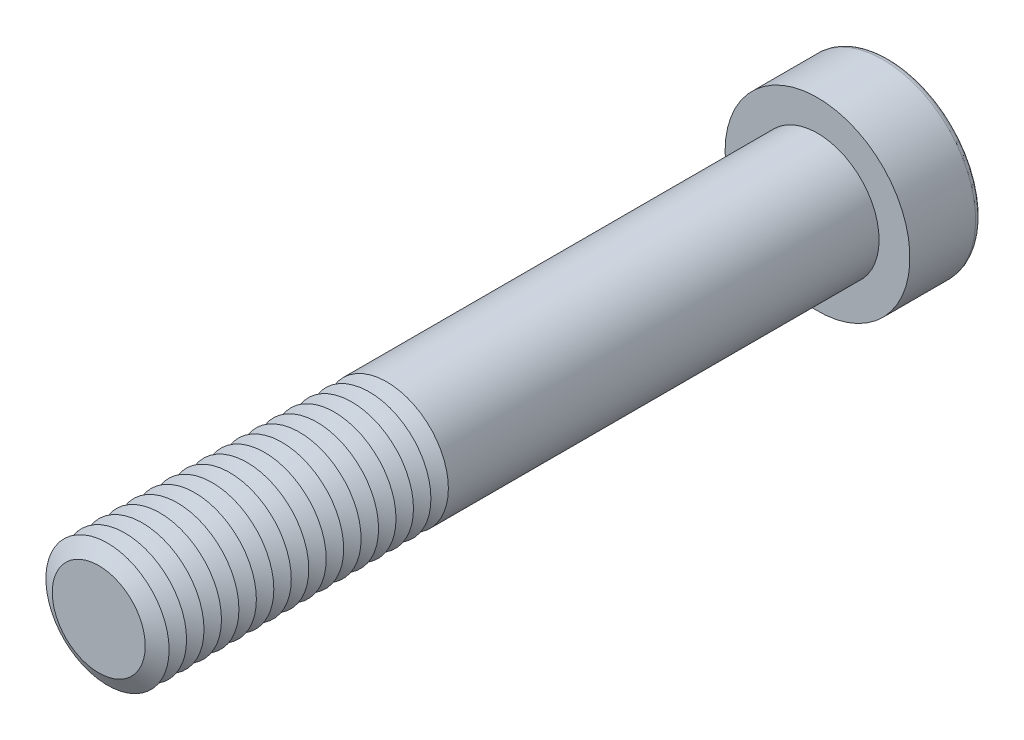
ISO-10303-21;
HEADER;
FILE_DESCRIPTION(('STEP AP214'),'2;1');
FILE_NAME('part.step','',(''),(''),'','','');
FILE_SCHEMA(('AUTOMOTIVE_DESIGN { 1 0 10303 214 1 1 1 1 }'));
ENDSEC;
DATA;
#1=APPLICATION_CONTEXT('core data for automotive mechanical design processes');
#2=APPLICATION_PROTOCOL_DEFINITION('international standard','automotive_design',2000,#1);
#3=PRODUCT_CONTEXT('',#1,'mechanical');
#4=PRODUCT('Part','Part','',(#3));
#5=PRODUCT_RELATED_PRODUCT_CATEGORY('part','',(#4));
#6=PRODUCT_DEFINITION_FORMATION('','',#4);
#7=PRODUCT_DEFINITION_CONTEXT('part definition',#1,'design');
#8=PRODUCT_DEFINITION('design','',#6,#7);
#9=PRODUCT_DEFINITION_SHAPE('','',#8);
#10=(LENGTH_UNIT() NAMED_UNIT(*) SI_UNIT(.MILLI.,.METRE.));
#11=(NAMED_UNIT(*) PLANE_ANGLE_UNIT() SI_UNIT($,.RADIAN.));
#12=(NAMED_UNIT(*) SI_UNIT($,.STERADIAN.) SOLID_ANGLE_UNIT());
#13=UNCERTAINTY_MEASURE_WITH_UNIT(LENGTH_MEASURE(1.E-05),#10,'distance_accuracy_value','');
#14=(GEOMETRIC_REPRESENTATION_CONTEXT(3) GLOBAL_UNCERTAINTY_ASSIGNED_CONTEXT((#13)) GLOBAL_UNIT_ASSIGNED_CONTEXT((#10,
#11,#12)) REPRESENTATION_CONTEXT('',''));
#15=CARTESIAN_POINT('',(0.,0.,0.));
#16=DIRECTION('',(0.,0.,1.));
#17=DIRECTION('',(1.,0.,0.));
#18=AXIS2_PLACEMENT_3D('',#15,#16,#17);
#19=CARTESIAN_POINT('',(0.,0.,64.05));
#20=DIRECTION('',(0.,0.,1.));
#21=DIRECTION('',(1.,0.,0.));
#22=AXIS2_PLACEMENT_3D('',#19,#20,#21);
#23=CONICAL_SURFACE('',#22,6.,1.0471975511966);
#24=CARTESIAN_POINT('',(0.,0.,63.2));
#25=DIRECTION('',(0.,0.,1.));
#26=DIRECTION('',(1.,0.,0.));
#27=AXIS2_PLACEMENT_3D('',#24,#25,#26);
#28=CIRCLE('',#27,4.52775681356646);
#29=CARTESIAN_POINT('',(4.52775681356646,0.,63.2));
#30=VERTEX_POINT('',#29);
#31=EDGE_CURVE('E311',#30,#30,#28,.T.);
#32=ORIENTED_EDGE('',*,*,#31,.T.);
#33=EDGE_LOOP('',(#32));
#34=FACE_BOUND('',#33,.T.);
#35=CARTESIAN_POINT('',(0.,0.,64.05));
#36=DIRECTION('',(0.,0.,1.));
#37=DIRECTION('',(1.,0.,0.));
#38=AXIS2_PLACEMENT_3D('',#35,#36,#37);
#39=CIRCLE('',#38,6.);
#40=CARTESIAN_POINT('',(6.,0.,64.05));
#41=VERTEX_POINT('',#40);
#42=EDGE_CURVE('E314',#41,#41,#39,.T.);
#43=ORIENTED_EDGE('',*,*,#42,.F.);
#44=EDGE_LOOP('',(#43));
#45=FACE_BOUND('',#44,.T.);
#46=ADVANCED_FACE('F39',(#34,#45),#23,.T.);
#47=CARTESIAN_POINT('',(0.,0.,63.2));
#48=DIRECTION('',(0.,0.,-1.));
#49=DIRECTION('',(-1.,0.,0.));
#50=AXIS2_PLACEMENT_3D('',#47,#48,#49);
#51=CONICAL_SURFACE('',#50,4.52775681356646,1.0471975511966);
#52=CARTESIAN_POINT('',(0.,0.,62.35));
#53=DIRECTION('',(0.,0.,1.));
#54=DIRECTION('',(1.,0.,0.));
#55=AXIS2_PLACEMENT_3D('',#52,#53,#54);
#56=CIRCLE('',#55,6.);
#57=CARTESIAN_POINT('',(6.,0.,62.35));
#58=VERTEX_POINT('',#57);
#59=EDGE_CURVE('E322',#58,#58,#56,.T.);
#60=ORIENTED_EDGE('',*,*,#59,.T.);
#61=EDGE_LOOP('',(#60));
#62=FACE_BOUND('',#61,.T.);
#63=ORIENTED_EDGE('',*,*,#31,.F.);
#64=EDGE_LOOP('',(#63));
#65=FACE_BOUND('',#64,.T.);
#66=ADVANCED_FACE('F243',(#62,#65),#51,.T.);
#67=CARTESIAN_POINT('',(0.,0.,70.));
#68=DIRECTION('',(0.,0.,1.));
#69=DIRECTION('',(1.,0.,0.));
#70=AXIS2_PLACEMENT_3D('',#67,#68,#69);
#71=PLANE('',#70);
#72=CARTESIAN_POINT('',(0.,0.,70.));
#73=DIRECTION('',(0.,0.,1.));
#74=DIRECTION('',(1.,0.,0.));
#75=AXIS2_PLACEMENT_3D('',#72,#73,#74);
#76=CIRCLE('',#75,4.52775681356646);
#77=CARTESIAN_POINT('',(4.52775681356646,0.,70.));
#78=VERTEX_POINT('',#77);
#79=EDGE_CURVE('E172',#78,#78,#76,.T.);
#80=ORIENTED_EDGE('',*,*,#79,.T.);
#81=EDGE_LOOP('',(#80));
#82=FACE_BOUND('',#81,.T.);
#83=ADVANCED_FACE('F249',(#82),#71,.T.);
#84=CARTESIAN_POINT('',(0.,0.,70.));
#85=DIRECTION('',(0.,0.,-1.));
#86=DIRECTION('',(-1.,0.,0.));
#87=AXIS2_PLACEMENT_3D('',#84,#85,#86);
#88=CONICAL_SURFACE('',#87,4.52775681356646,1.0471975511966);
#89=CARTESIAN_POINT('',(0.,0.,69.15));
#90=DIRECTION('',(0.,0.,1.));
#91=DIRECTION('',(1.,0.,0.));
#92=AXIS2_PLACEMENT_3D('',#89,#90,#91);
#93=CIRCLE('',#92,6.);
#94=CARTESIAN_POINT('',(6.,0.,69.15));
#95=VERTEX_POINT('',#94);
#96=EDGE_CURVE('E289',#95,#95,#93,.T.);
#97=ORIENTED_EDGE('',*,*,#96,.T.);
#98=EDGE_LOOP('',(#97));
#99=FACE_BOUND('',#98,.T.);
#100=ORIENTED_EDGE('',*,*,#79,.F.);
#101=EDGE_LOOP('',(#100));
#102=FACE_BOUND('',#101,.T.);
#103=ADVANCED_FACE('F197',(#99,#102),#88,.T.);
#104=CARTESIAN_POINT('',(0.,0.,69.15));
#105=DIRECTION('',(0.,0.,1.));
#106=DIRECTION('',(1.,0.,0.));
#107=AXIS2_PLACEMENT_3D('',#104,#105,#106);
#108=CONICAL_SURFACE('',#107,6.,1.0471975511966);
#109=CARTESIAN_POINT('',(0.,0.,68.3));
#110=DIRECTION('',(0.,0.,1.));
#111=DIRECTION('',(1.,0.,0.));
#112=AXIS2_PLACEMENT_3D('',#109,#110,#111);
#113=CIRCLE('',#112,4.52775681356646);
#114=CARTESIAN_POINT('',(4.52775681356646,0.,68.3));
#115=VERTEX_POINT('',#114);
#116=EDGE_CURVE('E286',#115,#115,#113,.T.);
#117=ORIENTED_EDGE('',*,*,#116,.T.);
#118=EDGE_LOOP('',(#117));
#119=FACE_BOUND('',#118,.T.);
#120=ORIENTED_EDGE('',*,*,#96,.F.);
#121=EDGE_LOOP('',(#120));
#122=FACE_BOUND('',#121,.T.);
#123=ADVANCED_FACE('F275',(#119,#122),#108,.T.);
#124=CARTESIAN_POINT('',(0.,0.,68.3));
#125=DIRECTION('',(0.,0.,-1.));
#126=DIRECTION('',(-1.,0.,0.));
#127=AXIS2_PLACEMENT_3D('',#124,#125,#126);
#128=CONICAL_SURFACE('',#127,4.52775681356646,1.0471975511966);
#129=CARTESIAN_POINT('',(0.,0.,67.45));
#130=DIRECTION('',(0.,0.,1.));
#131=DIRECTION('',(1.,0.,0.));
#132=AXIS2_PLACEMENT_3D('',#129,#130,#131);
#133=CIRCLE('',#132,6.);
#134=CARTESIAN_POINT('',(6.,0.,67.45));
#135=VERTEX_POINT('',#134);
#136=EDGE_CURVE('E298',#135,#135,#133,.T.);
#137=ORIENTED_EDGE('',*,*,#136,.T.);
#138=EDGE_LOOP('',(#137));
#139=FACE_BOUND('',#138,.T.);
#140=ORIENTED_EDGE('',*,*,#116,.F.);
#141=EDGE_LOOP('',(#140));
#142=FACE_BOUND('',#141,.T.);
#143=ADVANCED_FACE('F272',(#139,#142),#128,.T.);
#144=CARTESIAN_POINT('',(0.,0.,67.45));
#145=DIRECTION('',(0.,0.,1.));
#146=DIRECTION('',(1.,0.,0.));
#147=AXIS2_PLACEMENT_3D('',#144,#145,#146);
#148=CONICAL_SURFACE('',#147,6.,1.0471975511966);
#149=CARTESIAN_POINT('',(0.,0.,66.6));
#150=DIRECTION('',(0.,0.,1.));
#151=DIRECTION('',(1.,0.,0.));
#152=AXIS2_PLACEMENT_3D('',#149,#150,#151);
#153=CIRCLE('',#152,4.52775681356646);
#154=CARTESIAN_POINT('',(4.52775681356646,0.,66.6));
#155=VERTEX_POINT('',#154);
#156=EDGE_CURVE('E291',#155,#155,#153,.T.);
#157=ORIENTED_EDGE('',*,*,#156,.T.);
#158=EDGE_LOOP('',(#157));
#159=FACE_BOUND('',#158,.T.);
#160=ORIENTED_EDGE('',*,*,#136,.F.);
#161=EDGE_LOOP('',(#160));
#162=FACE_BOUND('',#161,.T.);
#163=ADVANCED_FACE('F268',(#159,#162),#148,.T.);
#164=CARTESIAN_POINT('',(0.,0.,66.6));
#165=DIRECTION('',(0.,0.,-1.));
#166=DIRECTION('',(-1.,0.,0.));
#167=AXIS2_PLACEMENT_3D('',#164,#165,#166);
#168=CONICAL_SURFACE('',#167,4.52775681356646,1.0471975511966);
#169=CARTESIAN_POINT('',(0.,0.,65.75));
#170=DIRECTION('',(0.,0.,1.));
#171=DIRECTION('',(1.,0.,0.));
#172=AXIS2_PLACEMENT_3D('',#169,#170,#171);
#173=CIRCLE('',#172,6.);
#174=CARTESIAN_POINT('',(6.,0.,65.75));
#175=VERTEX_POINT('',#174);
#176=EDGE_CURVE('E308',#175,#175,#173,.T.);
#177=ORIENTED_EDGE('',*,*,#176,.T.);
#178=EDGE_LOOP('',(#177));
#179=FACE_BOUND('',#178,.T.);
#180=ORIENTED_EDGE('',*,*,#156,.F.);
#181=EDGE_LOOP('',(#180));
#182=FACE_BOUND('',#181,.T.);
#183=ADVANCED_FACE('F264',(#179,#182),#168,.T.);
#184=CARTESIAN_POINT('',(0.,0.,65.75));
#185=DIRECTION('',(0.,0.,1.));
#186=DIRECTION('',(1.,0.,0.));
#187=AXIS2_PLACEMENT_3D('',#184,#185,#186);
#188=CONICAL_SURFACE('',#187,6.,1.0471975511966);
#189=CARTESIAN_POINT('',(0.,0.,64.9));
#190=DIRECTION('',(0.,0.,1.));
#191=DIRECTION('',(1.,0.,0.));
#192=AXIS2_PLACEMENT_3D('',#189,#190,#191);
#193=CIRCLE('',#192,4.52775681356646);
#194=CARTESIAN_POINT('',(4.52775681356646,0.,64.9));
#195=VERTEX_POINT('',#194);
#196=EDGE_CURVE('E304',#195,#195,#193,.T.);
#197=ORIENTED_EDGE('',*,*,#196,.T.);
#198=EDGE_LOOP('',(#197));
#199=FACE_BOUND('',#198,.T.);
#200=ORIENTED_EDGE('',*,*,#176,.F.);
#201=EDGE_LOOP('',(#200));
#202=FACE_BOUND('',#201,.T.);
#203=ADVANCED_FACE('F260',(#199,#202),#188,.T.);
#204=CARTESIAN_POINT('',(0.,0.,64.9));
#205=DIRECTION('',(0.,0.,-1.));
#206=DIRECTION('',(-1.,0.,0.));
#207=AXIS2_PLACEMENT_3D('',#204,#205,#206);
#208=CONICAL_SURFACE('',#207,4.52775681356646,1.0471975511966);
#209=ORIENTED_EDGE('',*,*,#42,.T.);
#210=EDGE_LOOP('',(#209));
#211=FACE_BOUND('',#210,.T.);
#212=ORIENTED_EDGE('',*,*,#196,.F.);
#213=EDGE_LOOP('',(#212));
#214=FACE_BOUND('',#213,.T.);
#215=ADVANCED_FACE('F256',(#211,#214),#208,.T.);
#216=CARTESIAN_POINT('',(0.,0.,62.35));
#217=DIRECTION('',(0.,0.,1.));
#218=DIRECTION('',(1.,0.,0.));
#219=AXIS2_PLACEMENT_3D('',#216,#217,#218);
#220=CONICAL_SURFACE('',#219,6.,1.0471975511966);
#221=CARTESIAN_POINT('',(0.,0.,61.5));
#222=DIRECTION('',(0.,0.,1.));
#223=DIRECTION('',(1.,0.,0.));
#224=AXIS2_PLACEMENT_3D('',#221,#222,#223);
#225=CIRCLE('',#224,4.52775681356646);
#226=CARTESIAN_POINT('',(4.52775681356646,0.,61.5));
#227=VERTEX_POINT('',#226);
#228=EDGE_CURVE('E318',#227,#227,#225,.T.);
#229=ORIENTED_EDGE('',*,*,#228,.T.);
#230=EDGE_LOOP('',(#229));
#231=FACE_BOUND('',#230,.T.);
#232=ORIENTED_EDGE('',*,*,#59,.F.);
#233=EDGE_LOOP('',(#232));
#234=FACE_BOUND('',#233,.T.);
#235=ADVANCED_FACE('F259',(#231,#234),#220,.T.);
#236=CARTESIAN_POINT('',(0.,0.,61.5));
#237=DIRECTION('',(0.,0.,-1.));
#238=DIRECTION('',(-1.,0.,0.));
#239=AXIS2_PLACEMENT_3D('',#236,#237,#238);
#240=CONICAL_SURFACE('',#239,4.52775681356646,1.0471975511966);
#241=CARTESIAN_POINT('',(0.,0.,60.65));
#242=DIRECTION('',(0.,0.,1.));
#243=DIRECTION('',(1.,0.,0.));
#244=AXIS2_PLACEMENT_3D('',#241,#242,#243);
#245=CIRCLE('',#244,6.);
#246=CARTESIAN_POINT('',(6.,0.,60.65));
#247=VERTEX_POINT('',#246);
#248=EDGE_CURVE('E330',#247,#247,#245,.T.);
#249=ORIENTED_EDGE('',*,*,#248,.T.);
#250=EDGE_LOOP('',(#249));
#251=FACE_BOUND('',#250,.T.);
#252=ORIENTED_EDGE('',*,*,#228,.F.);
#253=EDGE_LOOP('',(#252));
#254=FACE_BOUND('',#253,.T.);
#255=ADVANCED_FACE('F511',(#251,#254),#240,.T.);
#256=CARTESIAN_POINT('',(0.,0.,60.65));
#257=DIRECTION('',(0.,0.,1.));
#258=DIRECTION('',(1.,0.,0.));
#259=AXIS2_PLACEMENT_3D('',#256,#257,#258);
#260=CONICAL_SURFACE('',#259,6.,1.0471975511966);
#261=CARTESIAN_POINT('',(0.,0.,59.8));
#262=DIRECTION('',(0.,0.,1.));
#263=DIRECTION('',(1.,0.,0.));
#264=AXIS2_PLACEMENT_3D('',#261,#262,#263);
#265=CIRCLE('',#264,4.52775681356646);
#266=CARTESIAN_POINT('',(4.52775681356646,0.,59.8));
#267=VERTEX_POINT('',#266);
#268=EDGE_CURVE('E326',#267,#267,#265,.T.);
#269=ORIENTED_EDGE('',*,*,#268,.T.);
#270=EDGE_LOOP('',(#269));
#271=FACE_BOUND('',#270,.T.);
#272=ORIENTED_EDGE('',*,*,#248,.F.);
#273=EDGE_LOOP('',(#272));
#274=FACE_BOUND('',#273,.T.);
#275=ADVANCED_FACE('F507',(#271,#274),#260,.T.);
#276=CARTESIAN_POINT('',(0.,0.,59.8));
#277=DIRECTION('',(0.,0.,-1.));
#278=DIRECTION('',(-1.,0.,0.));
#279=AXIS2_PLACEMENT_3D('',#276,#277,#278);
#280=CONICAL_SURFACE('',#279,4.52775681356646,1.0471975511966);
#281=CARTESIAN_POINT('',(0.,0.,58.95));
#282=DIRECTION('',(0.,0.,1.));
#283=DIRECTION('',(1.,0.,0.));
#284=AXIS2_PLACEMENT_3D('',#281,#282,#283);
#285=CIRCLE('',#284,6.);
#286=CARTESIAN_POINT('',(6.,0.,58.95));
#287=VERTEX_POINT('',#286);
#288=EDGE_CURVE('E338',#287,#287,#285,.T.);
#289=ORIENTED_EDGE('',*,*,#288,.T.);
#290=EDGE_LOOP('',(#289));
#291=FACE_BOUND('',#290,.T.);
#292=ORIENTED_EDGE('',*,*,#268,.F.);
#293=EDGE_LOOP('',(#292));
#294=FACE_BOUND('',#293,.T.);
#295=ADVANCED_FACE('F503',(#291,#294),#280,.T.);
#296=CARTESIAN_POINT('',(0.,0.,58.95));
#297=DIRECTION('',(0.,0.,1.));
#298=DIRECTION('',(1.,0.,0.));
#299=AXIS2_PLACEMENT_3D('',#296,#297,#298);
#300=CONICAL_SURFACE('',#299,6.,1.0471975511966);
#301=CARTESIAN_POINT('',(0.,0.,58.1));
#302=DIRECTION('',(0.,0.,1.));
#303=DIRECTION('',(1.,0.,0.));
#304=AXIS2_PLACEMENT_3D('',#301,#302,#303);
#305=CIRCLE('',#304,4.52775681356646);
#306=CARTESIAN_POINT('',(4.52775681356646,0.,58.1));
#307=VERTEX_POINT('',#306);
#308=EDGE_CURVE('E334',#307,#307,#305,.T.);
#309=ORIENTED_EDGE('',*,*,#308,.T.);
#310=EDGE_LOOP('',(#309));
#311=FACE_BOUND('',#310,.T.);
#312=ORIENTED_EDGE('',*,*,#288,.F.);
#313=EDGE_LOOP('',(#312));
#314=FACE_BOUND('',#313,.T.);
#315=ADVANCED_FACE('F499',(#311,#314),#300,.T.);
#316=CARTESIAN_POINT('',(0.,0.,58.1));
#317=DIRECTION('',(0.,0.,-1.));
#318=DIRECTION('',(-1.,0.,0.));
#319=AXIS2_PLACEMENT_3D('',#316,#317,#318);
#320=CONICAL_SURFACE('',#319,4.52775681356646,1.0471975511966);
#321=CARTESIAN_POINT('',(0.,0.,57.25));
#322=DIRECTION('',(0.,0.,1.));
#323=DIRECTION('',(1.,0.,0.));
#324=AXIS2_PLACEMENT_3D('',#321,#322,#323);
#325=CIRCLE('',#324,6.);
#326=CARTESIAN_POINT('',(6.,0.,57.25));
#327=VERTEX_POINT('',#326);
#328=EDGE_CURVE('E346',#327,#327,#325,.T.);
#329=ORIENTED_EDGE('',*,*,#328,.T.);
#330=EDGE_LOOP('',(#329));
#331=FACE_BOUND('',#330,.T.);
#332=ORIENTED_EDGE('',*,*,#308,.F.);
#333=EDGE_LOOP('',(#332));
#334=FACE_BOUND('',#333,.T.);
#335=ADVANCED_FACE('F495',(#331,#334),#320,.T.);
#336=CARTESIAN_POINT('',(0.,0.,57.25));
#337=DIRECTION('',(0.,0.,1.));
#338=DIRECTION('',(1.,0.,0.));
#339=AXIS2_PLACEMENT_3D('',#336,#337,#338);
#340=CONICAL_SURFACE('',#339,6.,1.0471975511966);
#341=CARTESIAN_POINT('',(0.,0.,56.4));
#342=DIRECTION('',(0.,0.,1.));
#343=DIRECTION('',(1.,0.,0.));
#344=AXIS2_PLACEMENT_3D('',#341,#342,#343);
#345=CIRCLE('',#344,4.52775681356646);
#346=CARTESIAN_POINT('',(4.52775681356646,0.,56.4));
#347=VERTEX_POINT('',#346);
#348=EDGE_CURVE('E342',#347,#347,#345,.T.);
#349=ORIENTED_EDGE('',*,*,#348,.T.);
#350=EDGE_LOOP('',(#349));
#351=FACE_BOUND('',#350,.T.);
#352=ORIENTED_EDGE('',*,*,#328,.F.);
#353=EDGE_LOOP('',(#352));
#354=FACE_BOUND('',#353,.T.);
#355=ADVANCED_FACE('F491',(#351,#354),#340,.T.);
#356=CARTESIAN_POINT('',(0.,0.,56.4));
#357=DIRECTION('',(0.,0.,-1.));
#358=DIRECTION('',(-1.,0.,0.));
#359=AXIS2_PLACEMENT_3D('',#356,#357,#358);
#360=CONICAL_SURFACE('',#359,4.52775681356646,1.0471975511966);
#361=CARTESIAN_POINT('',(0.,0.,55.55));
#362=DIRECTION('',(0.,0.,1.));
#363=DIRECTION('',(1.,0.,0.));
#364=AXIS2_PLACEMENT_3D('',#361,#362,#363);
#365=CIRCLE('',#364,6.);
#366=CARTESIAN_POINT('',(6.,0.,55.55));
#367=VERTEX_POINT('',#366);
#368=EDGE_CURVE('E354',#367,#367,#365,.T.);
#369=ORIENTED_EDGE('',*,*,#368,.T.);
#370=EDGE_LOOP('',(#369));
#371=FACE_BOUND('',#370,.T.);
#372=ORIENTED_EDGE('',*,*,#348,.F.);
#373=EDGE_LOOP('',(#372));
#374=FACE_BOUND('',#373,.T.);
#375=ADVANCED_FACE('F487',(#371,#374),#360,.T.);
#376=CARTESIAN_POINT('',(0.,0.,55.55));
#377=DIRECTION('',(0.,0.,1.));
#378=DIRECTION('',(1.,0.,0.));
#379=AXIS2_PLACEMENT_3D('',#376,#377,#378);
#380=CONICAL_SURFACE('',#379,6.,1.0471975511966);
#381=CARTESIAN_POINT('',(0.,0.,54.7));
#382=DIRECTION('',(0.,0.,1.));
#383=DIRECTION('',(1.,0.,0.));
#384=AXIS2_PLACEMENT_3D('',#381,#382,#383);
#385=CIRCLE('',#384,4.52775681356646);
#386=CARTESIAN_POINT('',(4.52775681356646,0.,54.7));
#387=VERTEX_POINT('',#386);
#388=EDGE_CURVE('E350',#387,#387,#385,.T.);
#389=ORIENTED_EDGE('',*,*,#388,.T.);
#390=EDGE_LOOP('',(#389));
#391=FACE_BOUND('',#390,.T.);
#392=ORIENTED_EDGE('',*,*,#368,.F.);
#393=EDGE_LOOP('',(#392));
#394=FACE_BOUND('',#393,.T.);
#395=ADVANCED_FACE('F483',(#391,#394),#380,.T.);
#396=CARTESIAN_POINT('',(0.,0.,54.7));
#397=DIRECTION('',(0.,0.,-1.));
#398=DIRECTION('',(-1.,0.,0.));
#399=AXIS2_PLACEMENT_3D('',#396,#397,#398);
#400=CONICAL_SURFACE('',#399,4.52775681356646,1.0471975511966);
#401=CARTESIAN_POINT('',(0.,0.,53.85));
#402=DIRECTION('',(0.,0.,1.));
#403=DIRECTION('',(1.,0.,0.));
#404=AXIS2_PLACEMENT_3D('',#401,#402,#403);
#405=CIRCLE('',#404,6.);
#406=CARTESIAN_POINT('',(6.,0.,53.85));
#407=VERTEX_POINT('',#406);
#408=EDGE_CURVE('E362',#407,#407,#405,.T.);
#409=ORIENTED_EDGE('',*,*,#408,.T.);
#410=EDGE_LOOP('',(#409));
#411=FACE_BOUND('',#410,.T.);
#412=ORIENTED_EDGE('',*,*,#388,.F.);
#413=EDGE_LOOP('',(#412));
#414=FACE_BOUND('',#413,.T.);
#415=ADVANCED_FACE('F479',(#411,#414),#400,.T.);
#416=CARTESIAN_POINT('',(0.,0.,53.85));
#417=DIRECTION('',(0.,0.,1.));
#418=DIRECTION('',(1.,0.,0.));
#419=AXIS2_PLACEMENT_3D('',#416,#417,#418);
#420=CONICAL_SURFACE('',#419,6.,1.0471975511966);
#421=CARTESIAN_POINT('',(0.,0.,53.));
#422=DIRECTION('',(0.,0.,1.));
#423=DIRECTION('',(1.,0.,0.));
#424=AXIS2_PLACEMENT_3D('',#421,#422,#423);
#425=CIRCLE('',#424,4.52775681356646);
#426=CARTESIAN_POINT('',(4.52775681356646,0.,53.));
#427=VERTEX_POINT('',#426);
#428=EDGE_CURVE('E358',#427,#427,#425,.T.);
#429=ORIENTED_EDGE('',*,*,#428,.T.);
#430=EDGE_LOOP('',(#429));
#431=FACE_BOUND('',#430,.T.);
#432=ORIENTED_EDGE('',*,*,#408,.F.);
#433=EDGE_LOOP('',(#432));
#434=FACE_BOUND('',#433,.T.);
#435=ADVANCED_FACE('F475',(#431,#434),#420,.T.);
#436=CARTESIAN_POINT('',(0.,0.,53.));
#437=DIRECTION('',(0.,0.,-1.));
#438=DIRECTION('',(-1.,0.,0.));
#439=AXIS2_PLACEMENT_3D('',#436,#437,#438);
#440=CONICAL_SURFACE('',#439,4.52775681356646,1.0471975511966);
#441=CARTESIAN_POINT('',(0.,0.,52.15));
#442=DIRECTION('',(0.,0.,1.));
#443=DIRECTION('',(1.,0.,0.));
#444=AXIS2_PLACEMENT_3D('',#441,#442,#443);
#445=CIRCLE('',#444,6.);
#446=CARTESIAN_POINT('',(6.,0.,52.15));
#447=VERTEX_POINT('',#446);
#448=EDGE_CURVE('E370',#447,#447,#445,.T.);
#449=ORIENTED_EDGE('',*,*,#448,.T.);
#450=EDGE_LOOP('',(#449));
#451=FACE_BOUND('',#450,.T.);
#452=ORIENTED_EDGE('',*,*,#428,.F.);
#453=EDGE_LOOP('',(#452));
#454=FACE_BOUND('',#453,.T.);
#455=ADVANCED_FACE('F471',(#451,#454),#440,.T.);
#456=CARTESIAN_POINT('',(0.,0.,52.15));
#457=DIRECTION('',(0.,0.,1.));
#458=DIRECTION('',(1.,0.,0.));
#459=AXIS2_PLACEMENT_3D('',#456,#457,#458);
#460=CONICAL_SURFACE('',#459,6.,1.0471975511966);
#461=CARTESIAN_POINT('',(0.,0.,51.3));
#462=DIRECTION('',(0.,0.,1.));
#463=DIRECTION('',(1.,0.,0.));
#464=AXIS2_PLACEMENT_3D('',#461,#462,#463);
#465=CIRCLE('',#464,4.52775681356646);
#466=CARTESIAN_POINT('',(4.52775681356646,0.,51.3));
#467=VERTEX_POINT('',#466);
#468=EDGE_CURVE('E366',#467,#467,#465,.T.);
#469=ORIENTED_EDGE('',*,*,#468,.T.);
#470=EDGE_LOOP('',(#469));
#471=FACE_BOUND('',#470,.T.);
#472=ORIENTED_EDGE('',*,*,#448,.F.);
#473=EDGE_LOOP('',(#472));
#474=FACE_BOUND('',#473,.T.);
#475=ADVANCED_FACE('F467',(#471,#474),#460,.T.);
#476=CARTESIAN_POINT('',(0.,0.,51.3));
#477=DIRECTION('',(0.,0.,-1.));
#478=DIRECTION('',(-1.,0.,0.));
#479=AXIS2_PLACEMENT_3D('',#476,#477,#478);
#480=CONICAL_SURFACE('',#479,4.52775681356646,1.0471975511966);
#481=CARTESIAN_POINT('',(0.,0.,50.45));
#482=DIRECTION('',(0.,0.,1.));
#483=DIRECTION('',(1.,0.,0.));
#484=AXIS2_PLACEMENT_3D('',#481,#482,#483);
#485=CIRCLE('',#484,6.);
#486=CARTESIAN_POINT('',(6.,0.,50.45));
#487=VERTEX_POINT('',#486);
#488=EDGE_CURVE('E378',#487,#487,#485,.T.);
#489=ORIENTED_EDGE('',*,*,#488,.T.);
#490=EDGE_LOOP('',(#489));
#491=FACE_BOUND('',#490,.T.);
#492=ORIENTED_EDGE('',*,*,#468,.F.);
#493=EDGE_LOOP('',(#492));
#494=FACE_BOUND('',#493,.T.);
#495=ADVANCED_FACE('F463',(#491,#494),#480,.T.);
#496=CARTESIAN_POINT('',(0.,0.,50.45));
#497=DIRECTION('',(0.,0.,1.));
#498=DIRECTION('',(1.,0.,0.));
#499=AXIS2_PLACEMENT_3D('',#496,#497,#498);
#500=CONICAL_SURFACE('',#499,6.,1.0471975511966);
#501=CARTESIAN_POINT('',(0.,0.,49.6));
#502=DIRECTION('',(0.,0.,1.));
#503=DIRECTION('',(1.,0.,0.));
#504=AXIS2_PLACEMENT_3D('',#501,#502,#503);
#505=CIRCLE('',#504,4.52775681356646);
#506=CARTESIAN_POINT('',(4.52775681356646,0.,49.6));
#507=VERTEX_POINT('',#506);
#508=EDGE_CURVE('E374',#507,#507,#505,.T.);
#509=ORIENTED_EDGE('',*,*,#508,.T.);
#510=EDGE_LOOP('',(#509));
#511=FACE_BOUND('',#510,.T.);
#512=ORIENTED_EDGE('',*,*,#488,.F.);
#513=EDGE_LOOP('',(#512));
#514=FACE_BOUND('',#513,.T.);
#515=ADVANCED_FACE('F459',(#511,#514),#500,.T.);
#516=CARTESIAN_POINT('',(0.,0.,49.6));
#517=DIRECTION('',(0.,0.,-1.));
#518=DIRECTION('',(-1.,0.,0.));
#519=AXIS2_PLACEMENT_3D('',#516,#517,#518);
#520=CONICAL_SURFACE('',#519,4.52775681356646,1.0471975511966);
#521=CARTESIAN_POINT('',(0.,0.,48.75));
#522=DIRECTION('',(0.,0.,1.));
#523=DIRECTION('',(1.,0.,0.));
#524=AXIS2_PLACEMENT_3D('',#521,#522,#523);
#525=CIRCLE('',#524,6.);
#526=CARTESIAN_POINT('',(6.,0.,48.75));
#527=VERTEX_POINT('',#526);
#528=EDGE_CURVE('E386',#527,#527,#525,.T.);
#529=ORIENTED_EDGE('',*,*,#528,.T.);
#530=EDGE_LOOP('',(#529));
#531=FACE_BOUND('',#530,.T.);
#532=ORIENTED_EDGE('',*,*,#508,.F.);
#533=EDGE_LOOP('',(#532));
#534=FACE_BOUND('',#533,.T.);
#535=ADVANCED_FACE('F455',(#531,#534),#520,.T.);
#536=CARTESIAN_POINT('',(0.,0.,48.75));
#537=DIRECTION('',(0.,0.,1.));
#538=DIRECTION('',(1.,0.,0.));
#539=AXIS2_PLACEMENT_3D('',#536,#537,#538);
#540=CONICAL_SURFACE('',#539,6.,1.0471975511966);
#541=CARTESIAN_POINT('',(0.,0.,47.9));
#542=DIRECTION('',(0.,0.,1.));
#543=DIRECTION('',(1.,0.,0.));
#544=AXIS2_PLACEMENT_3D('',#541,#542,#543);
#545=CIRCLE('',#544,4.52775681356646);
#546=CARTESIAN_POINT('',(4.52775681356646,0.,47.9));
#547=VERTEX_POINT('',#546);
#548=EDGE_CURVE('E382',#547,#547,#545,.T.);
#549=ORIENTED_EDGE('',*,*,#548,.T.);
#550=EDGE_LOOP('',(#549));
#551=FACE_BOUND('',#550,.T.);
#552=ORIENTED_EDGE('',*,*,#528,.F.);
#553=EDGE_LOOP('',(#552));
#554=FACE_BOUND('',#553,.T.);
#555=ADVANCED_FACE('F451',(#551,#554),#540,.T.);
#556=CARTESIAN_POINT('',(0.,0.,47.9));
#557=DIRECTION('',(0.,0.,-1.));
#558=DIRECTION('',(-1.,0.,0.));
#559=AXIS2_PLACEMENT_3D('',#556,#557,#558);
#560=CONICAL_SURFACE('',#559,4.52775681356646,1.0471975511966);
#561=CARTESIAN_POINT('',(0.,0.,47.05));
#562=DIRECTION('',(0.,0.,1.));
#563=DIRECTION('',(1.,0.,0.));
#564=AXIS2_PLACEMENT_3D('',#561,#562,#563);
#565=CIRCLE('',#564,6.);
#566=CARTESIAN_POINT('',(6.,0.,47.05));
#567=VERTEX_POINT('',#566);
#568=EDGE_CURVE('E394',#567,#567,#565,.T.);
#569=ORIENTED_EDGE('',*,*,#568,.T.);
#570=EDGE_LOOP('',(#569));
#571=FACE_BOUND('',#570,.T.);
#572=ORIENTED_EDGE('',*,*,#548,.F.);
#573=EDGE_LOOP('',(#572));
#574=FACE_BOUND('',#573,.T.);
#575=ADVANCED_FACE('F447',(#571,#574),#560,.T.);
#576=CARTESIAN_POINT('',(0.,0.,47.05));
#577=DIRECTION('',(0.,0.,1.));
#578=DIRECTION('',(1.,0.,0.));
#579=AXIS2_PLACEMENT_3D('',#576,#577,#578);
#580=CONICAL_SURFACE('',#579,6.,1.0471975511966);
#581=CARTESIAN_POINT('',(0.,0.,46.2));
#582=DIRECTION('',(0.,0.,1.));
#583=DIRECTION('',(1.,0.,0.));
#584=AXIS2_PLACEMENT_3D('',#581,#582,#583);
#585=CIRCLE('',#584,4.52775681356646);
#586=CARTESIAN_POINT('',(4.52775681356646,0.,46.2));
#587=VERTEX_POINT('',#586);
#588=EDGE_CURVE('E390',#587,#587,#585,.T.);
#589=ORIENTED_EDGE('',*,*,#588,.T.);
#590=EDGE_LOOP('',(#589));
#591=FACE_BOUND('',#590,.T.);
#592=ORIENTED_EDGE('',*,*,#568,.F.);
#593=EDGE_LOOP('',(#592));
#594=FACE_BOUND('',#593,.T.);
#595=ADVANCED_FACE('F443',(#591,#594),#580,.T.);
#596=CARTESIAN_POINT('',(0.,0.,46.2));
#597=DIRECTION('',(0.,0.,-1.));
#598=DIRECTION('',(-1.,0.,0.));
#599=AXIS2_PLACEMENT_3D('',#596,#597,#598);
#600=CONICAL_SURFACE('',#599,4.52775681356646,1.0471975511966);
#601=CARTESIAN_POINT('',(0.,0.,45.35));
#602=DIRECTION('',(0.,0.,1.));
#603=DIRECTION('',(1.,0.,0.));
#604=AXIS2_PLACEMENT_3D('',#601,#602,#603);
#605=CIRCLE('',#604,6.);
#606=CARTESIAN_POINT('',(6.,0.,45.35));
#607=VERTEX_POINT('',#606);
#608=EDGE_CURVE('E402',#607,#607,#605,.T.);
#609=ORIENTED_EDGE('',*,*,#608,.T.);
#610=EDGE_LOOP('',(#609));
#611=FACE_BOUND('',#610,.T.);
#612=ORIENTED_EDGE('',*,*,#588,.F.);
#613=EDGE_LOOP('',(#612));
#614=FACE_BOUND('',#613,.T.);
#615=ADVANCED_FACE('F439',(#611,#614),#600,.T.);
#616=CARTESIAN_POINT('',(0.,0.,45.35));
#617=DIRECTION('',(0.,0.,1.));
#618=DIRECTION('',(1.,0.,0.));
#619=AXIS2_PLACEMENT_3D('',#616,#617,#618);
#620=CONICAL_SURFACE('',#619,6.,1.0471975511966);
#621=CARTESIAN_POINT('',(0.,0.,44.5));
#622=DIRECTION('',(0.,0.,1.));
#623=DIRECTION('',(1.,0.,0.));
#624=AXIS2_PLACEMENT_3D('',#621,#622,#623);
#625=CIRCLE('',#624,4.52775681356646);
#626=CARTESIAN_POINT('',(4.52775681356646,0.,44.5));
#627=VERTEX_POINT('',#626);
#628=EDGE_CURVE('E398',#627,#627,#625,.T.);
#629=ORIENTED_EDGE('',*,*,#628,.T.);
#630=EDGE_LOOP('',(#629));
#631=FACE_BOUND('',#630,.T.);
#632=ORIENTED_EDGE('',*,*,#608,.F.);
#633=EDGE_LOOP('',(#632));
#634=FACE_BOUND('',#633,.T.);
#635=ADVANCED_FACE('F434',(#631,#634),#620,.T.);
#636=CARTESIAN_POINT('',(0.,0.,44.5));
#637=DIRECTION('',(0.,0.,-1.));
#638=DIRECTION('',(-1.,0.,0.));
#639=AXIS2_PLACEMENT_3D('',#636,#637,#638);
#640=CONICAL_SURFACE('',#639,4.52775681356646,1.0471975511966);
#641=CARTESIAN_POINT('',(0.,0.,43.65));
#642=DIRECTION('',(0.,0.,1.));
#643=DIRECTION('',(1.,0.,0.));
#644=AXIS2_PLACEMENT_3D('',#641,#642,#643);
#645=CIRCLE('',#644,6.);
#646=CARTESIAN_POINT('',(6.,0.,43.65));
#647=VERTEX_POINT('',#646);
#648=EDGE_CURVE('E414',#647,#647,#645,.T.);
#649=ORIENTED_EDGE('',*,*,#648,.T.);
#650=EDGE_LOOP('',(#649));
#651=FACE_BOUND('',#650,.T.);
#652=ORIENTED_EDGE('',*,*,#628,.F.);
#653=EDGE_LOOP('',(#652));
#654=FACE_BOUND('',#653,.T.);
#655=ADVANCED_FACE('F420',(#651,#654),#640,.T.);
#656=CARTESIAN_POINT('',(0.,0.,43.65));
#657=DIRECTION('',(0.,0.,1.));
#658=DIRECTION('',(1.,0.,0.));
#659=AXIS2_PLACEMENT_3D('',#656,#657,#658);
#660=CONICAL_SURFACE('',#659,6.,1.0471975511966);
#661=CARTESIAN_POINT('',(0.,0.,42.8));
#662=DIRECTION('',(0.,0.,1.));
#663=DIRECTION('',(1.,0.,0.));
#664=AXIS2_PLACEMENT_3D('',#661,#662,#663);
#665=CIRCLE('',#664,4.52775681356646);
#666=CARTESIAN_POINT('',(4.52775681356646,0.,42.8));
#667=VERTEX_POINT('',#666);
#668=EDGE_CURVE('E406',#667,#667,#665,.T.);
#669=ORIENTED_EDGE('',*,*,#668,.T.);
#670=EDGE_LOOP('',(#669));
#671=FACE_BOUND('',#670,.T.);
#672=ORIENTED_EDGE('',*,*,#648,.F.);
#673=EDGE_LOOP('',(#672));
#674=FACE_BOUND('',#673,.T.);
#675=ADVANCED_FACE('F423',(#671,#674),#660,.T.);
#676=CARTESIAN_POINT('',(0.,0.,42.8));
#677=DIRECTION('',(0.,0.,-1.));
#678=DIRECTION('',(-1.,0.,0.));
#679=AXIS2_PLACEMENT_3D('',#676,#677,#678);
#680=CONICAL_SURFACE('',#679,4.52775681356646,1.0471975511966);
#681=CARTESIAN_POINT('',(0.,0.,41.95));
#682=DIRECTION('',(0.,0.,1.));
#683=DIRECTION('',(1.,0.,0.));
#684=AXIS2_PLACEMENT_3D('',#681,#682,#683);
#685=CIRCLE('',#684,6.);
#686=CARTESIAN_POINT('',(6.,0.,41.95));
#687=VERTEX_POINT('',#686);
#688=EDGE_CURVE('E410',#687,#687,#685,.T.);
#689=ORIENTED_EDGE('',*,*,#688,.T.);
#690=EDGE_LOOP('',(#689));
#691=FACE_BOUND('',#690,.T.);
#692=ORIENTED_EDGE('',*,*,#668,.F.);
#693=EDGE_LOOP('',(#692));
#694=FACE_BOUND('',#693,.T.);
#695=ADVANCED_FACE('F425',(#691,#694),#680,.T.);
#696=CARTESIAN_POINT('',(0.,0.,-1.));
#697=DIRECTION('',(0.,0.,-1.));
#698=DIRECTION('',(-1.,0.,0.));
#699=AXIS2_PLACEMENT_3D('',#696,#697,#698);
#700=CONICAL_SURFACE('',#699,4.,1.0471975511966);
#701=CARTESIAN_POINT('',(0.,0.,1.30940107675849));
#702=VERTEX_POINT('',#701);
#703=VERTEX_LOOP('',#702);
#704=FACE_BOUND('',#703,.T.);
#705=CARTESIAN_POINT('',(0.,0.,-1.));
#706=DIRECTION('',(0.,0.,-1.));
#707=DIRECTION('',(-1.,0.,0.));
#708=AXIS2_PLACEMENT_3D('',#705,#706,#707);
#709=CIRCLE('',#708,4.);
#710=CARTESIAN_POINT('',(-3.46410161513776,2.,-1.));
#711=VERTEX_POINT('',#710);
#712=CARTESIAN_POINT('',(0.,4.,-1.));
#713=VERTEX_POINT('',#712);
#714=EDGE_CURVE('E149',#711,#713,#709,.T.);
#715=ORIENTED_EDGE('',*,*,#714,.T.);
#716=CARTESIAN_POINT('',(0.,0.,-1.));
#717=DIRECTION('',(0.,0.,-1.));
#718=DIRECTION('',(-1.,0.,0.));
#719=AXIS2_PLACEMENT_3D('',#716,#717,#718);
#720=CIRCLE('',#719,4.);
#721=CARTESIAN_POINT('',(3.46410161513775,2.,-1.));
#722=VERTEX_POINT('',#721);
#723=EDGE_CURVE('E54',#713,#722,#720,.T.);
#724=ORIENTED_EDGE('',*,*,#723,.T.);
#725=CARTESIAN_POINT('',(3.46410161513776,-2.,-1.));
#726=VERTEX_POINT('',#725);
#727=EDGE_CURVE('E1028',#722,#726,#720,.T.);
#728=ORIENTED_EDGE('',*,*,#727,.T.);
#729=CARTESIAN_POINT('',(0.,-4.,-1.));
#730=VERTEX_POINT('',#729);
#731=EDGE_CURVE('E1026',#726,#730,#720,.T.);
#732=ORIENTED_EDGE('',*,*,#731,.T.);
#733=CARTESIAN_POINT('',(-3.46410161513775,-2.,-1.));
#734=VERTEX_POINT('',#733);
#735=EDGE_CURVE('E1021',#730,#734,#720,.T.);
#736=ORIENTED_EDGE('',*,*,#735,.T.);
#737=EDGE_CURVE('E1019',#734,#711,#720,.T.);
#738=ORIENTED_EDGE('',*,*,#737,.T.);
#739=EDGE_LOOP('',(#715,#724,#728,#732,#736,#738));
#740=FACE_BOUND('',#739,.T.);
#741=ADVANCED_FACE('F199',(#704,#740),#700,.F.);
#742=CARTESIAN_POINT('',(0.,0.,-1.));
#743=DIRECTION('',(0.,0.,-1.));
#744=DIRECTION('',(-1.,0.,0.));
#745=AXIS2_PLACEMENT_3D('',#742,#743,#744);
#746=PLANE('',#745);
#747=ORIENTED_EDGE('',*,*,#723,.F.);
#748=DIRECTION('',(1.,0.,0.));
#749=VECTOR('',#748,1.);
#750=CARTESIAN_POINT('',(-2.3094010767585,4.,-1.));
#751=LINE('',#750,#749);
#752=CARTESIAN_POINT('',(2.3094010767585,4.,-1.));
#753=VERTEX_POINT('',#752);
#754=EDGE_CURVE('E1068',#713,#753,#751,.T.);
#755=ORIENTED_EDGE('',*,*,#754,.T.);
#756=DIRECTION('',(0.5,-0.866025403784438,0.));
#757=VECTOR('',#756,1.);
#758=CARTESIAN_POINT('',(2.3094010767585,4.,-1.));
#759=LINE('',#758,#757);
#760=EDGE_CURVE('E155',#753,#722,#759,.T.);
#761=ORIENTED_EDGE('',*,*,#760,.T.);
#762=EDGE_LOOP('',(#747,#755,#761));
#763=FACE_BOUND('',#762,.T.);
#764=ADVANCED_FACE('F606',(#763),#746,.T.);
#765=ORIENTED_EDGE('',*,*,#727,.F.);
#766=CARTESIAN_POINT('',(4.61880215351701,0.,-1.));
#767=VERTEX_POINT('',#766);
#768=EDGE_CURVE('E1065',#722,#767,#759,.T.);
#769=ORIENTED_EDGE('',*,*,#768,.T.);
#770=DIRECTION('',(-0.5,-0.866025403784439,0.));
#771=VECTOR('',#770,1.);
#772=CARTESIAN_POINT('',(4.61880215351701,0.,-1.));
#773=LINE('',#772,#771);
#774=EDGE_CURVE('E1041',#767,#726,#773,.T.);
#775=ORIENTED_EDGE('',*,*,#774,.T.);
#776=EDGE_LOOP('',(#765,#769,#775));
#777=FACE_BOUND('',#776,.T.);
#778=ADVANCED_FACE('F616',(#777),#746,.T.);
#779=ORIENTED_EDGE('',*,*,#731,.F.);
#780=CARTESIAN_POINT('',(2.3094010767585,-4.,-1.));
#781=VERTEX_POINT('',#780);
#782=EDGE_CURVE('E1043',#726,#781,#773,.T.);
#783=ORIENTED_EDGE('',*,*,#782,.T.);
#784=DIRECTION('',(-1.,0.,0.));
#785=VECTOR('',#784,1.);
#786=CARTESIAN_POINT('',(2.3094010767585,-4.,-1.));
#787=LINE('',#786,#785);
#788=EDGE_CURVE('E993',#781,#730,#787,.T.);
#789=ORIENTED_EDGE('',*,*,#788,.T.);
#790=EDGE_LOOP('',(#779,#783,#789));
#791=FACE_BOUND('',#790,.T.);
#792=ADVANCED_FACE('F626',(#791),#746,.T.);
#793=ORIENTED_EDGE('',*,*,#735,.F.);
#794=CARTESIAN_POINT('',(-2.3094010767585,-4.,-1.));
#795=VERTEX_POINT('',#794);
#796=EDGE_CURVE('E1037',#730,#795,#787,.T.);
#797=ORIENTED_EDGE('',*,*,#796,.T.);
#798=DIRECTION('',(-0.5,0.866025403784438,0.));
#799=VECTOR('',#798,1.);
#800=CARTESIAN_POINT('',(-2.3094010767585,-4.,-1.));
#801=LINE('',#800,#799);
#802=EDGE_CURVE('E1039',#795,#734,#801,.T.);
#803=ORIENTED_EDGE('',*,*,#802,.T.);
#804=EDGE_LOOP('',(#793,#797,#803));
#805=FACE_BOUND('',#804,.T.);
#806=ADVANCED_FACE('F634',(#805),#746,.T.);
#807=ORIENTED_EDGE('',*,*,#737,.F.);
#808=CARTESIAN_POINT('',(-4.61880215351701,0.,-1.));
#809=VERTEX_POINT('',#808);
#810=EDGE_CURVE('E1045',#734,#809,#801,.T.);
#811=ORIENTED_EDGE('',*,*,#810,.T.);
#812=DIRECTION('',(0.5,0.866025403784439,0.));
#813=VECTOR('',#812,1.);
#814=CARTESIAN_POINT('',(-4.61880215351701,0.,-1.));
#815=LINE('',#814,#813);
#816=EDGE_CURVE('E158',#809,#711,#815,.T.);
#817=ORIENTED_EDGE('',*,*,#816,.T.);
#818=EDGE_LOOP('',(#807,#811,#817));
#819=FACE_BOUND('',#818,.T.);
#820=ADVANCED_FACE('F229',(#819),#746,.T.);
#821=ORIENTED_EDGE('',*,*,#714,.F.);
#822=CARTESIAN_POINT('',(-2.3094010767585,4.,-1.));
#823=VERTEX_POINT('',#822);
#824=EDGE_CURVE('E1051',#711,#823,#815,.T.);
#825=ORIENTED_EDGE('',*,*,#824,.T.);
#826=EDGE_CURVE('E1066',#823,#713,#751,.T.);
#827=ORIENTED_EDGE('',*,*,#826,.T.);
#828=EDGE_LOOP('',(#821,#825,#827));
#829=FACE_BOUND('',#828,.T.);
#830=ADVANCED_FACE('F618',(#829),#746,.T.);
#831=CARTESIAN_POINT('',(-2.3094010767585,4.,-1.));
#832=DIRECTION('',(0.,1.,0.));
#833=DIRECTION('',(0.,0.,1.));
#834=AXIS2_PLACEMENT_3D('',#831,#832,#833);
#835=PLANE('',#834);
#836=DIRECTION('',(0.,0.,-1.));
#837=VECTOR('',#836,1.);
#838=CARTESIAN_POINT('',(-2.3094010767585,4.,-1.));
#839=LINE('',#838,#837);
#840=CARTESIAN_POINT('',(-2.3094010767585,4.,-7.));
#841=VERTEX_POINT('',#840);
#842=EDGE_CURVE('E147',#823,#841,#839,.T.);
#843=ORIENTED_EDGE('',*,*,#842,.T.);
#844=CARTESIAN_POINT('',(-6.02881516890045,4.,-7.70103379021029));
#845=CARTESIAN_POINT('',(-5.8481958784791,4.,-7.66071709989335));
#846=CARTESIAN_POINT('',(-5.66746141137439,4.,-7.62090727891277));
#847=CARTESIAN_POINT('',(-5.30570552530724,4.,-7.54257487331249));
#848=CARTESIAN_POINT('',(-5.12468409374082,4.,-7.50405234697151));
#849=CARTESIAN_POINT('',(-4.76212658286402,4.,-7.42853268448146));
#850=CARTESIAN_POINT('',(-4.58059016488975,4.,-7.39153716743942));
#851=CARTESIAN_POINT('',(-4.21713405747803,4.,-7.31948392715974));
#852=CARTESIAN_POINT('',(-4.03521437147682,4.,-7.28442618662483));
#853=CARTESIAN_POINT('',(-3.67250657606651,4.,-7.21700168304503));
#854=CARTESIAN_POINT('',(-3.4917223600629,4.,-7.18461419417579));
#855=CARTESIAN_POINT('',(-3.12965653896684,4.,-7.12275774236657));
#856=CARTESIAN_POINT('',(-2.94837492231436,4.,-7.09328884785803));
#857=CARTESIAN_POINT('',(-2.40374454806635,4.,-7.01026455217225));
#858=CARTESIAN_POINT('',(-2.03952090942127,4.,-6.96207428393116));
#859=CARTESIAN_POINT('',(-1.48950033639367,4.,-6.90518200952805));
#860=CARTESIAN_POINT('',(-1.30450135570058,4.,-6.88873552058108));
#861=CARTESIAN_POINT('',(-0.934053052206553,4.,-6.86198845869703));
#862=CARTESIAN_POINT('',(-0.748603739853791,4.,-6.85168774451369));
#863=CARTESIAN_POINT('',(-0.377528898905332,4.,-6.83783090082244));
#864=CARTESIAN_POINT('',(-0.191903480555,4.,-6.83427186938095));
#865=CARTESIAN_POINT('',(0.179350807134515,4.,-6.83411569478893));
#866=CARTESIAN_POINT('',(0.364979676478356,4.,-6.83751856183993));
#867=CARTESIAN_POINT('',(0.736742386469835,4.,-6.85109802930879));
#868=CARTESIAN_POINT('',(0.922875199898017,4.,-6.86130219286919));
#869=CARTESIAN_POINT('',(1.29469888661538,4.,-6.8879135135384));
#870=CARTESIAN_POINT('',(1.48038973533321,4.,-6.90432100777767));
#871=CARTESIAN_POINT('',(1.85132520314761,4.,-6.94252995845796));
#872=CARTESIAN_POINT('',(2.036569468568,4.,-6.96433479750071));
#873=CARTESIAN_POINT('',(2.40646407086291,4.,-7.0124559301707));
#874=CARTESIAN_POINT('',(2.59111440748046,4.,-7.03877222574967));
#875=CARTESIAN_POINT('',(2.96467049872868,4.,-7.09583231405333));
#876=CARTESIAN_POINT('',(3.15356118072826,4.,-7.12667393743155));
#877=CARTESIAN_POINT('',(3.53080577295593,4.,-7.19148953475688));
#878=CARTESIAN_POINT('',(3.71915966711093,4.,-7.22546360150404));
#879=CARTESIAN_POINT('',(4.2835627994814,4.,-7.33112271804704));
#880=CARTESIAN_POINT('',(4.65891157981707,4.,-7.40653797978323));
#881=CARTESIAN_POINT('',(5.40835351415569,4.,-7.56376983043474));
#882=CARTESIAN_POINT('',(5.78244627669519,4.,-7.64558825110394));
#883=CARTESIAN_POINT('',(6.52968076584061,4.,-7.81348272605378));
#884=CARTESIAN_POINT('',(6.90282246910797,4.,-7.89955888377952));
#885=CARTESIAN_POINT('',(7.64386653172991,4.,-8.07356157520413));
#886=CARTESIAN_POINT('',(8.01177724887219,4.,-8.16145269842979));
#887=CARTESIAN_POINT('',(8.74711499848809,4.,-8.33926751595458));
#888=CARTESIAN_POINT('',(9.11454201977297,4.,-8.42919125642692));
#889=CARTESIAN_POINT('',(9.84851788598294,4.,-8.61039317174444));
#890=CARTESIAN_POINT('',(10.2150672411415,4.,-8.70166928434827));
#891=CARTESIAN_POINT('',(10.9478692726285,4.,-8.88534974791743));
#892=CARTESIAN_POINT('',(11.3141219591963,4.,-8.97775405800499));
#893=CARTESIAN_POINT('',(11.6802738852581,4.,-9.07055157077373));
#894=B_SPLINE_CURVE_WITH_KNOTS('',3,(#844,#845,#846,#847,#848,#849,#850,#851,#852,#853,#854,
#855,#856,#857,#858,#859,#860,#861,#862,#863,#864,#865,#866,#867,#868,#869,#870,#871,#872,#873,
#874,#875,#876,#877,#878,#879,#880,#881,#882,#883,#884,#885,#886,#887,#888,#889,#890,#891,#892,
#893),.UNSPECIFIED.,.F.,.F.,(4,2,2,2,2,2,2,2,2,2,2,2,2,2,2,2,2,2,2,2,2,2,2,2,4),(0.,
0.555194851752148,1.11041480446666,1.6662090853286,2.22199840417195,2.77296094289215,
3.32393639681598,4.42561440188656,4.98271716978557,5.5398071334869,6.09665724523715,
6.65350817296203,7.2126296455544,7.77178150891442,8.33128469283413,8.89078811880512,
9.46493123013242,10.0390913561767,11.1875388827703,12.3363161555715,13.4851213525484,
14.6199040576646,15.7547125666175,16.8879395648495,18.0211256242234),.UNSPECIFIED.);
#895=CARTESIAN_POINT('',(2.3094010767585,4.,-7.));
#896=VERTEX_POINT('',#895);
#897=EDGE_CURVE('E124',#841,#896,#894,.T.);
#898=ORIENTED_EDGE('',*,*,#897,.T.);
#899=DIRECTION('',(0.,0.,-1.));
#900=VECTOR('',#899,1.);
#901=CARTESIAN_POINT('',(2.3094010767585,4.,-1.));
#902=LINE('',#901,#900);
#903=EDGE_CURVE('E143',#753,#896,#902,.T.);
#904=ORIENTED_EDGE('',*,*,#903,.F.);
#905=ORIENTED_EDGE('',*,*,#754,.F.);
#906=ORIENTED_EDGE('',*,*,#826,.F.);
#907=EDGE_LOOP('',(#843,#898,#904,#905,#906));
#908=FACE_BOUND('',#907,.T.);
#909=ADVANCED_FACE('F141',(#908),#835,.F.);
#910=CARTESIAN_POINT('',(2.3094010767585,4.,-1.));
#911=DIRECTION('',(0.866025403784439,0.5,0.));
#912=DIRECTION('',(-0.5,0.866025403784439,0.));
#913=AXIS2_PLACEMENT_3D('',#910,#911,#912);
#914=PLANE('',#913);
#915=ORIENTED_EDGE('',*,*,#903,.T.);
#916=CARTESIAN_POINT('',(2.30928560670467,4.0002,-7.0000309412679));
#917=CARTESIAN_POINT('',(2.40519879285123,3.83407348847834,-6.97431943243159));
#918=CARTESIAN_POINT('',(2.50128588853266,3.66764575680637,-6.95097756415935));
#919=CARTESIAN_POINT('',(2.69379944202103,3.33420250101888,-6.90996801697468));
#920=CARTESIAN_POINT('',(2.79022602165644,3.16718676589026,-6.89230264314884));
#921=CARTESIAN_POINT('',(2.98283386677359,2.83358019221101,-6.86367744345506));
#922=CARTESIAN_POINT('',(3.07901382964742,2.66699160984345,-6.85268347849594));
#923=CARTESIAN_POINT('',(3.27149641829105,2.33360198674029,-6.83794168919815));
#924=CARTESIAN_POINT('',(3.3677990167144,2.16680099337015,-6.83419246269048));
#925=CARTESIAN_POINT('',(3.56040421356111,1.83319900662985,-6.83419246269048));
#926=CARTESIAN_POINT('',(3.65670681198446,1.66639801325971,-6.83794168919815));
#927=CARTESIAN_POINT('',(3.84918940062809,1.33300839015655,-6.85268347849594));
#928=CARTESIAN_POINT('',(3.94536936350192,1.16641980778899,-6.86367744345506));
#929=CARTESIAN_POINT('',(4.13797720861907,0.832813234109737,-6.89230264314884));
#930=CARTESIAN_POINT('',(4.23440378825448,0.66579749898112,-6.90996801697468));
#931=CARTESIAN_POINT('',(4.42691734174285,0.332354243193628,-6.95097756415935));
#932=CARTESIAN_POINT('',(4.52300443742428,0.165926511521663,-6.97431943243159));
#933=CARTESIAN_POINT('',(4.61891762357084,-0.000199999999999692,-7.0000309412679));
#934=B_SPLINE_CURVE_WITH_KNOTS('',3,(#916,#917,#918,#919,#920,#921,#922,#923,#924,#925,#926,
#927,#928,#929,#930,#931,#932,#933),.UNSPECIFIED.,.F.,.F.,(4,2,2,2,2,2,2,2,4),(0.,
0.580655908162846,1.1615473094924,1.73944052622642,2.31722188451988,2.89500324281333,
3.47289645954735,4.0537878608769,4.63444376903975),.UNSPECIFIED.);
#935=CARTESIAN_POINT('',(4.61880215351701,0.,-7.));
#936=VERTEX_POINT('',#935);
#937=EDGE_CURVE('E11',#896,#936,#934,.T.);
#938=ORIENTED_EDGE('',*,*,#937,.T.);
#939=DIRECTION('',(0.,0.,-1.));
#940=VECTOR('',#939,1.);
#941=CARTESIAN_POINT('',(4.61880215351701,0.,-1.));
#942=LINE('',#941,#940);
#943=EDGE_CURVE('E157',#767,#936,#942,.T.);
#944=ORIENTED_EDGE('',*,*,#943,.F.);
#945=ORIENTED_EDGE('',*,*,#768,.F.);
#946=ORIENTED_EDGE('',*,*,#760,.F.);
#947=EDGE_LOOP('',(#915,#938,#944,#945,#946));
#948=FACE_BOUND('',#947,.T.);
#949=ADVANCED_FACE('F152',(#948),#914,.F.);
#950=CARTESIAN_POINT('',(4.61880215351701,0.,-1.));
#951=DIRECTION('',(0.866025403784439,-0.5,0.));
#952=DIRECTION('',(0.5,0.866025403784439,0.));
#953=AXIS2_PLACEMENT_3D('',#950,#951,#952);
#954=PLANE('',#953);
#955=ORIENTED_EDGE('',*,*,#943,.T.);
#956=CARTESIAN_POINT('',(4.61891762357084,0.00020000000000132,-7.0000309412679));
#957=CARTESIAN_POINT('',(4.52300443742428,-0.165926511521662,-6.97431943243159));
#958=CARTESIAN_POINT('',(4.42691734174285,-0.332354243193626,-6.95097756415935));
#959=CARTESIAN_POINT('',(4.23440378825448,-0.665797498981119,-6.90996801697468));
#960=CARTESIAN_POINT('',(4.13797720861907,-0.832813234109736,-6.89230264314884));
#961=CARTESIAN_POINT('',(3.94536936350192,-1.16641980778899,-6.86367744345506));
#962=CARTESIAN_POINT('',(3.84918940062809,-1.33300839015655,-6.85268347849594));
#963=CARTESIAN_POINT('',(3.65670681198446,-1.66639801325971,-6.83794168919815));
#964=CARTESIAN_POINT('',(3.56040421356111,-1.83319900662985,-6.83419246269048));
#965=CARTESIAN_POINT('',(3.3677990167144,-2.16680099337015,-6.83419246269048));
#966=CARTESIAN_POINT('',(3.27149641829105,-2.33360198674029,-6.83794168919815));
#967=CARTESIAN_POINT('',(3.07901382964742,-2.66699160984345,-6.85268347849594));
#968=CARTESIAN_POINT('',(2.98283386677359,-2.83358019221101,-6.86367744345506));
#969=CARTESIAN_POINT('',(2.79022602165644,-3.16718676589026,-6.89230264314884));
#970=CARTESIAN_POINT('',(2.69379944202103,-3.33420250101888,-6.90996801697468));
#971=CARTESIAN_POINT('',(2.50128588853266,-3.66764575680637,-6.95097756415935));
#972=CARTESIAN_POINT('',(2.40519879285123,-3.83407348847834,-6.97431943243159));
#973=CARTESIAN_POINT('',(2.30928560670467,-4.0002,-7.0000309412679));
#974=B_SPLINE_CURVE_WITH_KNOTS('',3,(#956,#957,#958,#959,#960,#961,#962,#963,#964,#965,#966,
#967,#968,#969,#970,#971,#972,#973),.UNSPECIFIED.,.F.,.F.,(4,2,2,2,2,2,2,2,4),(0.,
0.580655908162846,1.1615473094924,1.73944052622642,2.31722188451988,2.89500324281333,
3.47289645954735,4.0537878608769,4.63444376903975),.UNSPECIFIED.);
#975=CARTESIAN_POINT('',(2.3094010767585,-4.,-7.));
#976=VERTEX_POINT('',#975);
#977=EDGE_CURVE('E171',#936,#976,#974,.T.);
#978=ORIENTED_EDGE('',*,*,#977,.T.);
#979=DIRECTION('',(0.,0.,-1.));
#980=VECTOR('',#979,1.);
#981=CARTESIAN_POINT('',(2.3094010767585,-4.,-1.));
#982=LINE('',#981,#980);
#983=EDGE_CURVE('E988',#781,#976,#982,.T.);
#984=ORIENTED_EDGE('',*,*,#983,.F.);
#985=ORIENTED_EDGE('',*,*,#782,.F.);
#986=ORIENTED_EDGE('',*,*,#774,.F.);
#987=EDGE_LOOP('',(#955,#978,#984,#985,#986));
#988=FACE_BOUND('',#987,.T.);
#989=ADVANCED_FACE('F189',(#988),#954,.F.);
#990=CARTESIAN_POINT('',(2.3094010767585,-4.,-1.));
#991=DIRECTION('',(0.,-1.,0.));
#992=DIRECTION('',(0.,0.,-1.));
#993=AXIS2_PLACEMENT_3D('',#990,#991,#992);
#994=PLANE('',#993);
#995=ORIENTED_EDGE('',*,*,#983,.T.);
#996=CARTESIAN_POINT('',(-6.02881516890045,-4.,-7.70103379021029));
#997=CARTESIAN_POINT('',(-5.8481958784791,-4.,-7.66071709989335));
#998=CARTESIAN_POINT('',(-5.66746141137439,-4.,-7.62090727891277));
#999=CARTESIAN_POINT('',(-5.30570552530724,-4.,-7.54257487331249));
#1000=CARTESIAN_POINT('',(-5.12468409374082,-4.,-7.50405234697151));
#1001=CARTESIAN_POINT('',(-4.76212658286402,-4.,-7.42853268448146));
#1002=CARTESIAN_POINT('',(-4.58059016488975,-4.,-7.39153716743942));
#1003=CARTESIAN_POINT('',(-4.21713405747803,-4.,-7.31948392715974));
#1004=CARTESIAN_POINT('',(-4.03521437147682,-4.,-7.28442618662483));
#1005=CARTESIAN_POINT('',(-3.67250657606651,-4.,-7.21700168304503));
#1006=CARTESIAN_POINT('',(-3.49172236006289,-4.,-7.18461419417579));
#1007=CARTESIAN_POINT('',(-3.12965653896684,-4.,-7.12275774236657));
#1008=CARTESIAN_POINT('',(-2.94837492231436,-4.,-7.09328884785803));
#1009=CARTESIAN_POINT('',(-2.40374454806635,-4.,-7.01026455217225));
#1010=CARTESIAN_POINT('',(-2.03952090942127,-4.,-6.96207428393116));
#1011=CARTESIAN_POINT('',(-1.48950033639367,-4.,-6.90518200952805));
#1012=CARTESIAN_POINT('',(-1.30450135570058,-4.,-6.88873552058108));
#1013=CARTESIAN_POINT('',(-0.934053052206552,-4.,-6.86198845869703));
#1014=CARTESIAN_POINT('',(-0.748603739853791,-4.,-6.85168774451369));
#1015=CARTESIAN_POINT('',(-0.377528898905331,-4.,-6.83783090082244));
#1016=CARTESIAN_POINT('',(-0.191903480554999,-4.,-6.83427186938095));
#1017=CARTESIAN_POINT('',(0.179350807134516,-4.,-6.83411569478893));
#1018=CARTESIAN_POINT('',(0.364979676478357,-4.,-6.83751856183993));
#1019=CARTESIAN_POINT('',(0.736742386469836,-4.,-6.85109802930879));
#1020=CARTESIAN_POINT('',(0.922875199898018,-4.,-6.86130219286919));
#1021=CARTESIAN_POINT('',(1.29469888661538,-4.,-6.8879135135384));
#1022=CARTESIAN_POINT('',(1.48038973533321,-4.,-6.90432100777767));
#1023=CARTESIAN_POINT('',(1.85132520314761,-4.,-6.94252995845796));
#1024=CARTESIAN_POINT('',(2.036569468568,-4.,-6.96433479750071));
#1025=CARTESIAN_POINT('',(2.40646407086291,-4.,-7.0124559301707));
#1026=CARTESIAN_POINT('',(2.59111440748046,-4.,-7.03877222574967));
#1027=CARTESIAN_POINT('',(2.96467049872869,-4.,-7.09583231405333));
#1028=CARTESIAN_POINT('',(3.15356118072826,-4.,-7.12667393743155));
#1029=CARTESIAN_POINT('',(3.53080577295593,-4.,-7.19148953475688));
#1030=CARTESIAN_POINT('',(3.71915966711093,-4.,-7.22546360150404));
#1031=CARTESIAN_POINT('',(4.2835627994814,-4.,-7.33112271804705));
#1032=CARTESIAN_POINT('',(4.65891157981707,-4.,-7.40653797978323));
#1033=CARTESIAN_POINT('',(5.40835351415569,-4.,-7.56376983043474));
#1034=CARTESIAN_POINT('',(5.78244627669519,-4.,-7.64558825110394));
#1035=CARTESIAN_POINT('',(6.52968076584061,-4.,-7.81348272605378));
#1036=CARTESIAN_POINT('',(6.90282246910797,-4.,-7.89955888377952));
#1037=CARTESIAN_POINT('',(7.64386653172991,-4.,-8.07356157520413));
#1038=CARTESIAN_POINT('',(8.01177724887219,-4.,-8.16145269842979));
#1039=CARTESIAN_POINT('',(8.74711499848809,-4.,-8.33926751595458));
#1040=CARTESIAN_POINT('',(9.11454201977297,-4.,-8.42919125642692));
#1041=CARTESIAN_POINT('',(9.84851788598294,-4.,-8.61039317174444));
#1042=CARTESIAN_POINT('',(10.2150672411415,-4.,-8.70166928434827));
#1043=CARTESIAN_POINT('',(10.9478692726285,-4.,-8.88534974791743));
#1044=CARTESIAN_POINT('',(11.3141219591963,-4.,-8.97775405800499));
#1045=CARTESIAN_POINT('',(11.6802738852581,-4.,-9.07055157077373));
#1046=B_SPLINE_CURVE_WITH_KNOTS('',3,(#996,#997,#998,#999,#1000,#1001,#1002,#1003,#1004,#1005,
#1006,#1007,#1008,#1009,#1010,#1011,#1012,#1013,#1014,#1015,#1016,#1017,#1018,#1019,#1020,#1021,
#1022,#1023,#1024,#1025,#1026,#1027,#1028,#1029,#1030,#1031,#1032,#1033,#1034,#1035,#1036,#1037,
#1038,#1039,#1040,#1041,#1042,#1043,#1044,#1045),.UNSPECIFIED.,.F.,.F.,(4,2,2,2,2,2,2,2,2,2,2,2,
2,2,2,2,2,2,2,2,2,2,2,2,4),(0.,0.555194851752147,1.11041480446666,1.6662090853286,
2.22199840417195,2.77296094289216,3.32393639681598,4.42561440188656,4.98271716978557,
5.5398071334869,6.09665724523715,6.65350817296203,7.2126296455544,7.77178150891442,
8.33128469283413,8.89078811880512,9.46493123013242,10.0390913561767,11.1875388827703,
12.3363161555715,13.4851213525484,14.6199040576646,15.7547125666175,16.8879395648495,
18.0211256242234),.UNSPECIFIED.);
#1047=CARTESIAN_POINT('',(-2.3094010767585,-4.,-7.));
#1048=VERTEX_POINT('',#1047);
#1049=EDGE_CURVE('E182',#976,#1048,#1046,.F.);
#1050=ORIENTED_EDGE('',*,*,#1049,.T.);
#1051=DIRECTION('',(0.,0.,-1.));
#1052=VECTOR('',#1051,1.);
#1053=CARTESIAN_POINT('',(-2.3094010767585,-4.,-1.));
#1054=LINE('',#1053,#1052);
#1055=EDGE_CURVE('E995',#795,#1048,#1054,.T.);
#1056=ORIENTED_EDGE('',*,*,#1055,.F.);
#1057=ORIENTED_EDGE('',*,*,#796,.F.);
#1058=ORIENTED_EDGE('',*,*,#788,.F.);
#1059=EDGE_LOOP('',(#995,#1050,#1056,#1057,#1058));
#1060=FACE_BOUND('',#1059,.T.);
#1061=ADVANCED_FACE('F232',(#1060),#994,.F.);
#1062=CARTESIAN_POINT('',(-2.3094010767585,-4.,-1.));
#1063=DIRECTION('',(-0.866025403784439,-0.5,0.));
#1064=DIRECTION('',(0.5,-0.866025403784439,0.));
#1065=AXIS2_PLACEMENT_3D('',#1062,#1063,#1064);
#1066=PLANE('',#1065);
#1067=ORIENTED_EDGE('',*,*,#1055,.T.);
#1068=CARTESIAN_POINT('',(-2.30928560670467,-4.0002,-7.0000309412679));
#1069=CARTESIAN_POINT('',(-2.40519879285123,-3.83407348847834,-6.97431943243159));
#1070=CARTESIAN_POINT('',(-2.50128588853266,-3.66764575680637,-6.95097756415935));
#1071=CARTESIAN_POINT('',(-2.69379944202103,-3.33420250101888,-6.90996801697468));
#1072=CARTESIAN_POINT('',(-2.79022602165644,-3.16718676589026,-6.89230264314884));
#1073=CARTESIAN_POINT('',(-2.98283386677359,-2.83358019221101,-6.86367744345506));
#1074=CARTESIAN_POINT('',(-3.07901382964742,-2.66699160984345,-6.85268347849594));
#1075=CARTESIAN_POINT('',(-3.27149641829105,-2.33360198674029,-6.83794168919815));
#1076=CARTESIAN_POINT('',(-3.3677990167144,-2.16680099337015,-6.83419246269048));
#1077=CARTESIAN_POINT('',(-3.56040421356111,-1.83319900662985,-6.83419246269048));
#1078=CARTESIAN_POINT('',(-3.65670681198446,-1.66639801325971,-6.83794168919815));
#1079=CARTESIAN_POINT('',(-3.84918940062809,-1.33300839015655,-6.85268347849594));
#1080=CARTESIAN_POINT('',(-3.94536936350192,-1.16641980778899,-6.86367744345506));
#1081=CARTESIAN_POINT('',(-4.13797720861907,-0.832813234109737,-6.89230264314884));
#1082=CARTESIAN_POINT('',(-4.23440378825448,-0.66579749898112,-6.90996801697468));
#1083=CARTESIAN_POINT('',(-4.42691734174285,-0.332354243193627,-6.95097756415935));
#1084=CARTESIAN_POINT('',(-4.52300443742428,-0.165926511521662,-6.97431943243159));
#1085=CARTESIAN_POINT('',(-4.61891762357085,0.000200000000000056,-7.0000309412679));
#1086=B_SPLINE_CURVE_WITH_KNOTS('',3,(#1068,#1069,#1070,#1071,#1072,#1073,#1074,#1075,#1076,
#1077,#1078,#1079,#1080,#1081,#1082,#1083,#1084,#1085),.UNSPECIFIED.,.F.,.F.,(4,2,2,2,2,2,2,2,
4),(0.,0.580655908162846,1.1615473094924,1.73944052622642,2.31722188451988,2.89500324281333,
3.47289645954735,4.05378786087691,4.63444376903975),.UNSPECIFIED.);
#1087=CARTESIAN_POINT('',(-4.61880215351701,0.,-7.));
#1088=VERTEX_POINT('',#1087);
#1089=EDGE_CURVE('E206',#1048,#1088,#1086,.T.);
#1090=ORIENTED_EDGE('',*,*,#1089,.T.);
#1091=DIRECTION('',(0.,0.,-1.));
#1092=VECTOR('',#1091,1.);
#1093=CARTESIAN_POINT('',(-4.61880215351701,0.,-1.));
#1094=LINE('',#1093,#1092);
#1095=EDGE_CURVE('E999',#809,#1088,#1094,.T.);
#1096=ORIENTED_EDGE('',*,*,#1095,.F.);
#1097=ORIENTED_EDGE('',*,*,#810,.F.);
#1098=ORIENTED_EDGE('',*,*,#802,.F.);
#1099=EDGE_LOOP('',(#1067,#1090,#1096,#1097,#1098));
#1100=FACE_BOUND('',#1099,.T.);
#1101=ADVANCED_FACE('F227',(#1100),#1066,.F.);
#1102=CARTESIAN_POINT('',(-4.61880215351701,0.,-1.));
#1103=DIRECTION('',(-0.866025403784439,0.5,0.));
#1104=DIRECTION('',(-0.5,-0.866025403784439,0.));
#1105=AXIS2_PLACEMENT_3D('',#1102,#1103,#1104);
#1106=PLANE('',#1105);
#1107=ORIENTED_EDGE('',*,*,#1095,.T.);
#1108=CARTESIAN_POINT('',(-4.61891762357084,-0.000200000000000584,-7.0000309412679));
#1109=CARTESIAN_POINT('',(-4.52300443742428,0.165926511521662,-6.97431943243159));
#1110=CARTESIAN_POINT('',(-4.42691734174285,0.332354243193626,-6.95097756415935));
#1111=CARTESIAN_POINT('',(-4.23440378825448,0.66579749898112,-6.90996801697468));
#1112=CARTESIAN_POINT('',(-4.13797720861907,0.832813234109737,-6.89230264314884));
#1113=CARTESIAN_POINT('',(-3.94536936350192,1.16641980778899,-6.86367744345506));
#1114=CARTESIAN_POINT('',(-3.84918940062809,1.33300839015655,-6.85268347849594));
#1115=CARTESIAN_POINT('',(-3.65670681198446,1.66639801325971,-6.83794168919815));
#1116=CARTESIAN_POINT('',(-3.56040421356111,1.83319900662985,-6.83419246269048));
#1117=CARTESIAN_POINT('',(-3.3677990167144,2.16680099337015,-6.83419246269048));
#1118=CARTESIAN_POINT('',(-3.27149641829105,2.33360198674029,-6.83794168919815));
#1119=CARTESIAN_POINT('',(-3.07901382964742,2.66699160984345,-6.85268347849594));
#1120=CARTESIAN_POINT('',(-2.98283386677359,2.83358019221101,-6.86367744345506));
#1121=CARTESIAN_POINT('',(-2.79022602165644,3.16718676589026,-6.89230264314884));
#1122=CARTESIAN_POINT('',(-2.69379944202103,3.33420250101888,-6.90996801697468));
#1123=CARTESIAN_POINT('',(-2.50128588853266,3.66764575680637,-6.95097756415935));
#1124=CARTESIAN_POINT('',(-2.40519879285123,3.83407348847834,-6.97431943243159));
#1125=CARTESIAN_POINT('',(-2.30928560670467,4.0002,-7.0000309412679));
#1126=B_SPLINE_CURVE_WITH_KNOTS('',3,(#1108,#1109,#1110,#1111,#1112,#1113,#1114,#1115,#1116,
#1117,#1118,#1119,#1120,#1121,#1122,#1123,#1124,#1125),.UNSPECIFIED.,.F.,.F.,(4,2,2,2,2,2,2,2,
4),(0.,0.580655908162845,1.1615473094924,1.73944052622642,2.31722188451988,2.89500324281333,
3.47289645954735,4.05378786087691,4.63444376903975),.UNSPECIFIED.);
#1127=EDGE_CURVE('E150',#1088,#841,#1126,.T.);
#1128=ORIENTED_EDGE('',*,*,#1127,.T.);
#1129=ORIENTED_EDGE('',*,*,#842,.F.);
#1130=ORIENTED_EDGE('',*,*,#824,.F.);
#1131=ORIENTED_EDGE('',*,*,#816,.F.);
#1132=EDGE_LOOP('',(#1107,#1128,#1129,#1130,#1131));
#1133=FACE_BOUND('',#1132,.T.);
#1134=ADVANCED_FACE('F195',(#1133),#1106,.F.);
#1135=CARTESIAN_POINT('',(0.,0.,-7.));
#1136=DIRECTION('',(0.,0.,-1.));
#1137=DIRECTION('',(-1.,0.,0.));
#1138=AXIS2_PLACEMENT_3D('',#1135,#1136,#1137);
#1139=CONICAL_SURFACE('',#1138,4.61880215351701,1.30899693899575);
#1140=CARTESIAN_POINT('',(0.,0.,-7.));
#1141=DIRECTION('',(0.,0.,-1.));
#1142=DIRECTION('',(-1.,0.,0.));
#1143=AXIS2_PLACEMENT_3D('',#1140,#1141,#1142);
#1144=CIRCLE('',#1143,4.61880215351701);
#1145=EDGE_CURVE('E120',#841,#896,#1144,.T.);
#1146=ORIENTED_EDGE('',*,*,#1145,.T.);
#1147=ORIENTED_EDGE('',*,*,#897,.F.);
#1148=EDGE_LOOP('',(#1146,#1147));
#1149=FACE_BOUND('',#1148,.T.);
#1150=ADVANCED_FACE('F122',(#1149),#1139,.F.);
#1151=EDGE_CURVE('E129',#896,#936,#1144,.T.);
#1152=ORIENTED_EDGE('',*,*,#1151,.T.);
#1153=ORIENTED_EDGE('',*,*,#937,.F.);
#1154=EDGE_LOOP('',(#1152,#1153));
#1155=FACE_BOUND('',#1154,.T.);
#1156=ADVANCED_FACE('F133',(#1155),#1139,.F.);
#1157=EDGE_CURVE('E164',#936,#976,#1144,.T.);
#1158=ORIENTED_EDGE('',*,*,#1157,.T.);
#1159=ORIENTED_EDGE('',*,*,#977,.F.);
#1160=EDGE_LOOP('',(#1158,#1159));
#1161=FACE_BOUND('',#1160,.T.);
#1162=ADVANCED_FACE('F699',(#1161),#1139,.F.);
#1163=EDGE_CURVE('E167',#976,#1048,#1144,.T.);
#1164=ORIENTED_EDGE('',*,*,#1163,.T.);
#1165=ORIENTED_EDGE('',*,*,#1049,.F.);
#1166=EDGE_LOOP('',(#1164,#1165));
#1167=FACE_BOUND('',#1166,.T.);
#1168=ADVANCED_FACE('F706',(#1167),#1139,.F.);
#1169=EDGE_CURVE('E67',#1048,#1088,#1144,.T.);
#1170=ORIENTED_EDGE('',*,*,#1169,.T.);
#1171=ORIENTED_EDGE('',*,*,#1089,.F.);
#1172=EDGE_LOOP('',(#1170,#1171));
#1173=FACE_BOUND('',#1172,.T.);
#1174=ADVANCED_FACE('F714',(#1173),#1139,.F.);
#1175=EDGE_CURVE('E60',#1088,#841,#1144,.T.);
#1176=ORIENTED_EDGE('',*,*,#1175,.T.);
#1177=ORIENTED_EDGE('',*,*,#1127,.F.);
#1178=EDGE_LOOP('',(#1176,#1177));
#1179=FACE_BOUND('',#1178,.T.);
#1180=ADVANCED_FACE('F196',(#1179),#1139,.F.);
#1181=CARTESIAN_POINT('',(0.,0.,-7.));
#1182=DIRECTION('',(0.,0.,-1.));
#1183=DIRECTION('',(-1.,0.,0.));
#1184=AXIS2_PLACEMENT_3D('',#1181,#1182,#1183);
#1185=PLANE('',#1184);
#1186=ORIENTED_EDGE('',*,*,#1175,.F.);
#1187=ORIENTED_EDGE('',*,*,#1169,.F.);
#1188=ORIENTED_EDGE('',*,*,#1163,.F.);
#1189=ORIENTED_EDGE('',*,*,#1157,.F.);
#1190=ORIENTED_EDGE('',*,*,#1151,.F.);
#1191=ORIENTED_EDGE('',*,*,#1145,.F.);
#1192=EDGE_LOOP('',(#1186,#1187,#1188,#1189,#1190,#1191));
#1193=FACE_BOUND('',#1192,.T.);
#1194=CARTESIAN_POINT('',(0.,0.,-7.));
#1195=DIRECTION('',(0.,0.,-1.));
#1196=DIRECTION('',(-1.,0.,0.));
#1197=AXIS2_PLACEMENT_3D('',#1194,#1195,#1196);
#1198=CIRCLE('',#1197,8.4);
#1199=CARTESIAN_POINT('',(-8.4,0.,-7.));
#1200=VERTEX_POINT('',#1199);
#1201=EDGE_CURVE('E1012',#1200,#1200,#1198,.T.);
#1202=ORIENTED_EDGE('',*,*,#1201,.T.);
#1203=EDGE_LOOP('',(#1202));
#1204=FACE_BOUND('',#1203,.T.);
#1205=ADVANCED_FACE('F161',(#1193,#1204),#1185,.T.);
#1206=CARTESIAN_POINT('',(0.,0.,-6.4));
#1207=DIRECTION('',(0.,0.,-1.));
#1208=DIRECTION('',(-1.,0.,0.));
#1209=AXIS2_PLACEMENT_3D('',#1206,#1207,#1208);
#1210=TOROIDAL_SURFACE('',#1209,8.4,0.6);
#1211=CARTESIAN_POINT('',(0.,0.,-6.4));
#1212=DIRECTION('',(0.,0.,-1.));
#1213=DIRECTION('',(-1.,0.,0.));
#1214=AXIS2_PLACEMENT_3D('',#1211,#1212,#1213);
#1215=CIRCLE('',#1214,9.);
#1216=CARTESIAN_POINT('',(-9.,0.,-6.4));
#1217=VERTEX_POINT('',#1216);
#1218=EDGE_CURVE('E1016',#1217,#1217,#1215,.F.);
#1219=ORIENTED_EDGE('',*,*,#1218,.F.);
#1220=EDGE_LOOP('',(#1219));
#1221=FACE_BOUND('',#1220,.T.);
#1222=ORIENTED_EDGE('',*,*,#1201,.F.);
#1223=EDGE_LOOP('',(#1222));
#1224=FACE_BOUND('',#1223,.T.);
#1225=ADVANCED_FACE('F41',(#1221,#1224),#1210,.T.);
#1226=CARTESIAN_POINT('',(0.,0.,-7.));
#1227=DIRECTION('',(0.,0.,1.));
#1228=DIRECTION('',(1.,0.,0.));
#1229=AXIS2_PLACEMENT_3D('',#1226,#1227,#1228);
#1230=CYLINDRICAL_SURFACE('',#1229,9.);
#1231=ORIENTED_EDGE('',*,*,#1218,.T.);
#1232=EDGE_LOOP('',(#1231));
#1233=FACE_BOUND('',#1232,.T.);
#1234=CARTESIAN_POINT('',(0.,0.,0.));
#1235=DIRECTION('',(0.,0.,-1.));
#1236=DIRECTION('',(-1.,0.,0.));
#1237=AXIS2_PLACEMENT_3D('',#1234,#1235,#1236);
#1238=CIRCLE('',#1237,9.);
#1239=CARTESIAN_POINT('',(-9.,0.,0.));
#1240=VERTEX_POINT('',#1239);
#1241=EDGE_CURVE('E1004',#1240,#1240,#1238,.T.);
#1242=ORIENTED_EDGE('',*,*,#1241,.T.);
#1243=EDGE_LOOP('',(#1242));
#1244=FACE_BOUND('',#1243,.T.);
#1245=ADVANCED_FACE('F738',(#1233,#1244),#1230,.T.);
#1246=CARTESIAN_POINT('',(0.,0.,0.));
#1247=DIRECTION('',(0.,0.,-1.));
#1248=DIRECTION('',(-1.,0.,0.));
#1249=AXIS2_PLACEMENT_3D('',#1246,#1247,#1248);
#1250=PLANE('',#1249);
#1251=CARTESIAN_POINT('',(0.,0.,0.));
#1252=DIRECTION('',(0.,0.,1.));
#1253=DIRECTION('',(1.,0.,0.));
#1254=AXIS2_PLACEMENT_3D('',#1251,#1252,#1253);
#1255=CIRCLE('',#1254,6.);
#1256=CARTESIAN_POINT('',(6.,0.,0.));
#1257=VERTEX_POINT('',#1256);
#1258=EDGE_CURVE('E1008',#1257,#1257,#1255,.T.);
#1259=ORIENTED_EDGE('',*,*,#1258,.F.);
#1260=EDGE_LOOP('',(#1259));
#1261=FACE_BOUND('',#1260,.T.);
#1262=ORIENTED_EDGE('',*,*,#1241,.F.);
#1263=EDGE_LOOP('',(#1262));
#1264=FACE_BOUND('',#1263,.T.);
#1265=ADVANCED_FACE('F746',(#1261,#1264),#1250,.F.);
#1266=CARTESIAN_POINT('',(0.,0.,70.));
#1267=DIRECTION('',(0.,0.,-1.));
#1268=DIRECTION('',(-1.,0.,0.));
#1269=AXIS2_PLACEMENT_3D('',#1266,#1267,#1268);
#1270=CYLINDRICAL_SURFACE('',#1269,6.);
#1271=ORIENTED_EDGE('',*,*,#1258,.T.);
#1272=EDGE_LOOP('',(#1271));
#1273=FACE_BOUND('',#1272,.T.);
#1274=ORIENTED_EDGE('',*,*,#688,.F.);
#1275=EDGE_LOOP('',(#1274));
#1276=FACE_BOUND('',#1275,.T.);
#1277=ADVANCED_FACE('F755',(#1273,#1276),#1270,.T.);
#1278=CLOSED_SHELL('',(#46,#66,#83,#103,#123,#143,#163,#183,#203,#215,#235,#255,#275,#295,#315,
#335,#355,#375,#395,#415,#435,#455,#475,#495,#515,#535,#555,#575,#595,#615,#635,#655,#675,#695,
#741,#764,#778,#792,#806,#820,#830,#909,#949,#989,#1061,#1101,#1134,#1150,#1156,#1162,#1168,
#1174,#1180,#1205,#1225,#1245,#1265,#1277));
#1279=MANIFOLD_SOLID_BREP('B2',#1278);
#1280=ADVANCED_BREP_SHAPE_REPRESENTATION('',(#18,#1279),#14);
#1281=SHAPE_DEFINITION_REPRESENTATION(#9,#1280);
ENDSEC;
END-ISO-10303-21;
